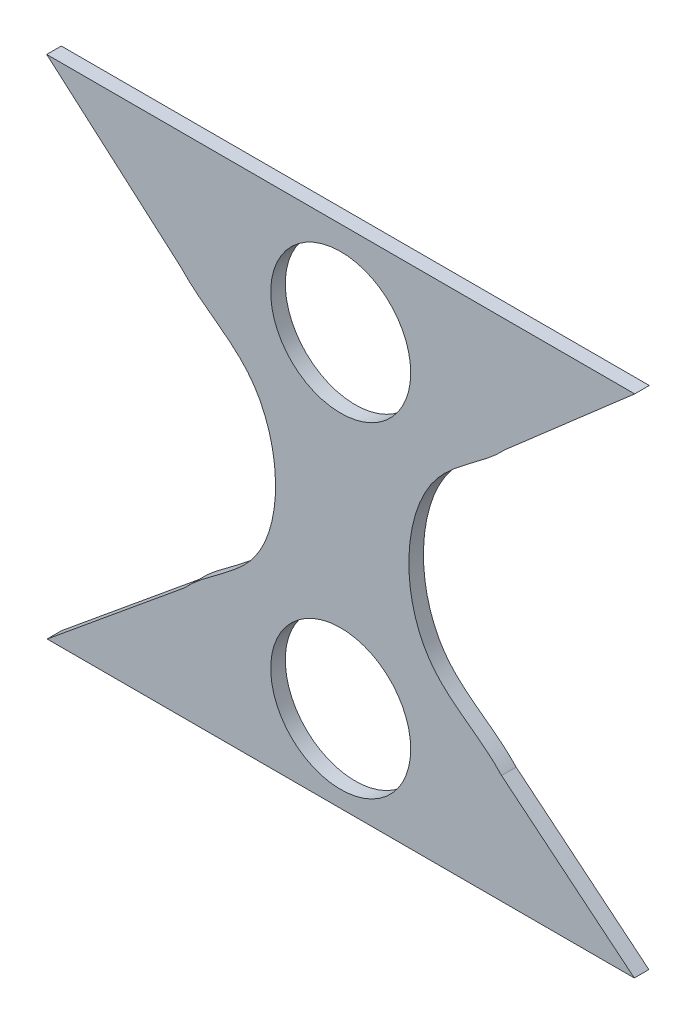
from build123d import *

# Parameters (mm, degrees)
SKETCH1_R           = 60
BOSS_EXTRUDE1_DEPTH = 12.5


with BuildPart() as part:
    # Sketch1 → Boss-Extrude1 (new body)
    with BuildSketch(Plane.XY):
        with BuildLine():
            Line((-252, 220), (-136.985292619, 119.590334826))
            add(Edge.make_bspline(
                [(-136.985292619, 119.590334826), (-119.179009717, 100.253738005), (-51.311388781, 69.258854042), (-46.856891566, -66.79598888), (-116.610031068, -97.790678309), (-134.152341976, -117.117123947)],
                knots=[0, 0, 0, 0, 0.270923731, 0.729212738, 1, 1, 1, 1], degree=3))
            Line((-134.152341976, -117.117123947), (-251.640883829, -213.75))
            Line((-251.640883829, -213.75), (251.640161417, -213.75))
            Line((251.640161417, -213.75), (137.881648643, -120.372867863))
            add(Edge.make_bspline(
                [(140.793352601, 122.914831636), (122.918741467, 103.647265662), (53.55268245, 71.237364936), (48.95810148, -68.685079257), (120.246229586, -101.095183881), (137.881648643, -120.372867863)],
                knots=[0, 0, 0, 0, 0.264790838, 0.735075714, 1, 1, 1, 1], degree=3))
            Line((140.793352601, 122.914831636), (252, 220))
            Line((252, 220), (-252, 220))
        make_face()
        with Locations((0, -139.650441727)):
            Circle(SKETCH1_R, mode=Mode.SUBTRACT)
        with Locations((0, 139.650441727)):
            Circle(SKETCH1_R, mode=Mode.SUBTRACT)
    extrude(amount=-BOSS_EXTRUDE1_DEPTH)


solid = part.part
